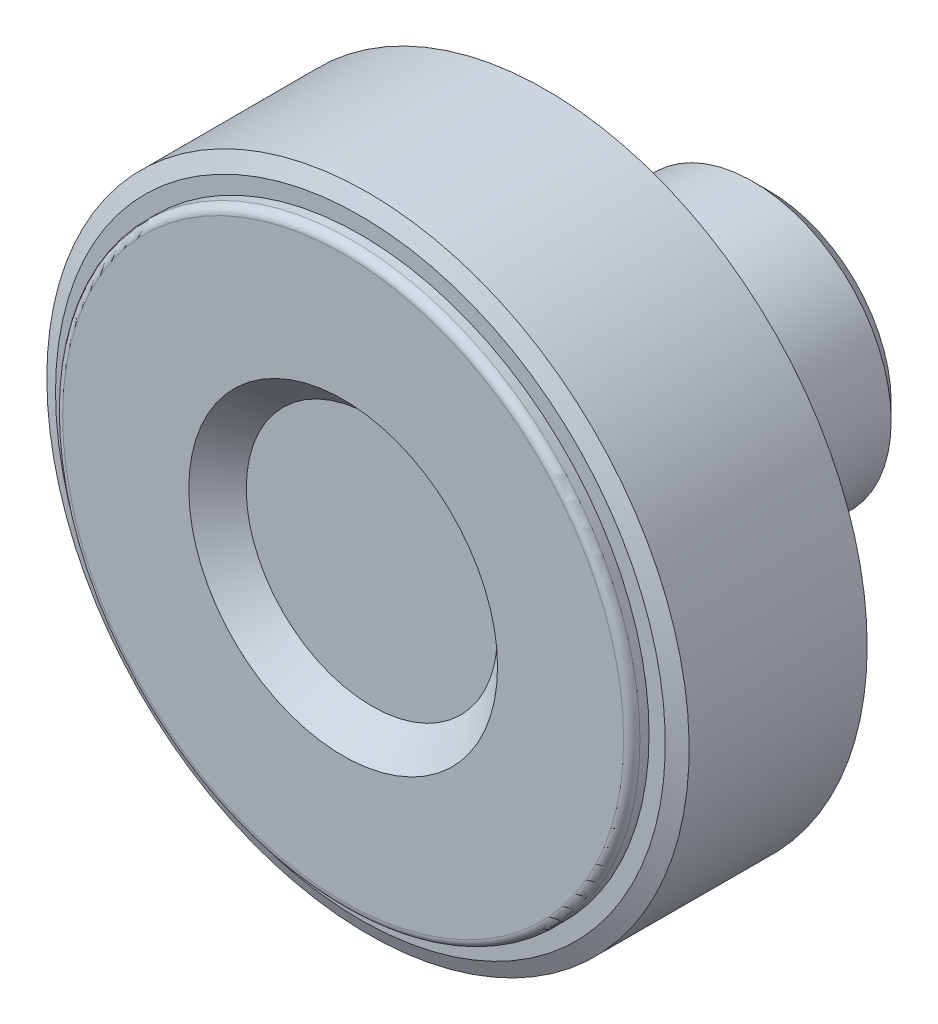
ISO-10303-21;
HEADER;
FILE_DESCRIPTION(('STEP AP214'),'2;1');
FILE_NAME('part.step','',(''),(''),'','','');
FILE_SCHEMA(('AUTOMOTIVE_DESIGN { 1 0 10303 214 1 1 1 1 }'));
ENDSEC;
DATA;
#1=APPLICATION_CONTEXT('core data for automotive mechanical design processes');
#2=APPLICATION_PROTOCOL_DEFINITION('international standard','automotive_design',2000,#1);
#3=PRODUCT_CONTEXT('',#1,'mechanical');
#4=PRODUCT('Part','Part','',(#3));
#5=PRODUCT_RELATED_PRODUCT_CATEGORY('part','',(#4));
#6=PRODUCT_DEFINITION_FORMATION('','',#4);
#7=PRODUCT_DEFINITION_CONTEXT('part definition',#1,'design');
#8=PRODUCT_DEFINITION('design','',#6,#7);
#9=PRODUCT_DEFINITION_SHAPE('','',#8);
#10=(LENGTH_UNIT() NAMED_UNIT(*) SI_UNIT(.MILLI.,.METRE.));
#11=(NAMED_UNIT(*) PLANE_ANGLE_UNIT() SI_UNIT($,.RADIAN.));
#12=(NAMED_UNIT(*) SI_UNIT($,.STERADIAN.) SOLID_ANGLE_UNIT());
#13=UNCERTAINTY_MEASURE_WITH_UNIT(LENGTH_MEASURE(1.E-05),#10,'distance_accuracy_value','');
#14=(GEOMETRIC_REPRESENTATION_CONTEXT(3) GLOBAL_UNCERTAINTY_ASSIGNED_CONTEXT((#13)) GLOBAL_UNIT_ASSIGNED_CONTEXT((#10,
#11,#12)) REPRESENTATION_CONTEXT('',''));
#15=CARTESIAN_POINT('',(0.,0.,0.));
#16=DIRECTION('',(0.,0.,1.));
#17=DIRECTION('',(1.,0.,0.));
#18=AXIS2_PLACEMENT_3D('',#15,#16,#17);
#19=CARTESIAN_POINT('',(0.,2.66666666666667,0.));
#20=DIRECTION('',(0.,0.,-1.));
#21=DIRECTION('',(-1.,0.,0.));
#22=AXIS2_PLACEMENT_3D('',#19,#20,#21);
#23=PLANE('',#22);
#24=CARTESIAN_POINT('',(0.,0.,0.));
#25=DIRECTION('',(0.,0.,-1.));
#26=DIRECTION('',(-1.,0.,0.));
#27=AXIS2_PLACEMENT_3D('',#24,#25,#26);
#28=CIRCLE('',#27,4.4999999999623);
#29=CARTESIAN_POINT('',(-4.4999999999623,0.,0.));
#30=VERTEX_POINT('',#29);
#31=EDGE_CURVE('E9',#30,#30,#28,.F.);
#32=ORIENTED_EDGE('',*,*,#31,.T.);
#33=EDGE_LOOP('',(#32));
#34=FACE_BOUND('',#33,.T.);
#35=CARTESIAN_POINT('',(0.,0.,0.));
#36=DIRECTION('',(0.,0.,1.));
#37=DIRECTION('',(1.,0.,0.));
#38=AXIS2_PLACEMENT_3D('',#35,#36,#37);
#39=CIRCLE('',#38,5.33333333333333);
#40=CARTESIAN_POINT('',(5.33333333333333,0.,0.));
#41=VERTEX_POINT('',#40);
#42=EDGE_CURVE('E211',#41,#41,#39,.T.);
#43=ORIENTED_EDGE('',*,*,#42,.F.);
#44=EDGE_LOOP('',(#43));
#45=FACE_BOUND('',#44,.T.);
#46=ADVANCED_FACE('F14',(#34,#45),#23,.T.);
#47=CARTESIAN_POINT('',(0.,0.,0.15));
#48=DIRECTION('',(0.,0.,1.));
#49=DIRECTION('',(1.,0.,0.));
#50=AXIS2_PLACEMENT_3D('',#47,#48,#49);
#51=CYLINDRICAL_SURFACE('',#50,5.33333333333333);
#52=ORIENTED_EDGE('',*,*,#42,.T.);
#53=EDGE_LOOP('',(#52));
#54=FACE_BOUND('',#53,.T.);
#55=CARTESIAN_POINT('',(0.,0.,0.3));
#56=DIRECTION('',(0.,0.,1.));
#57=DIRECTION('',(1.,0.,0.));
#58=AXIS2_PLACEMENT_3D('',#55,#56,#57);
#59=CIRCLE('',#58,5.33333333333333);
#60=CARTESIAN_POINT('',(5.33333333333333,0.,0.3));
#61=VERTEX_POINT('',#60);
#62=EDGE_CURVE('E208',#61,#61,#59,.T.);
#63=ORIENTED_EDGE('',*,*,#62,.F.);
#64=EDGE_LOOP('',(#63));
#65=FACE_BOUND('',#64,.T.);
#66=ADVANCED_FACE('F407',(#54,#65),#51,.T.);
#67=CARTESIAN_POINT('',(0.,6.41666666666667,0.3));
#68=DIRECTION('',(0.,0.,-1.));
#69=DIRECTION('',(-1.,0.,0.));
#70=AXIS2_PLACEMENT_3D('',#67,#68,#69);
#71=PLANE('',#70);
#72=CARTESIAN_POINT('',(0.,0.,0.3));
#73=DIRECTION('',(0.,0.,1.));
#74=DIRECTION('',(1.,0.,0.));
#75=AXIS2_PLACEMENT_3D('',#72,#73,#74);
#76=CIRCLE('',#75,7.5);
#77=CARTESIAN_POINT('',(7.5,0.,0.3));
#78=VERTEX_POINT('',#77);
#79=EDGE_CURVE('E177',#78,#78,#76,.T.);
#80=ORIENTED_EDGE('',*,*,#79,.F.);
#81=EDGE_LOOP('',(#80));
#82=FACE_BOUND('',#81,.T.);
#83=ORIENTED_EDGE('',*,*,#62,.T.);
#84=EDGE_LOOP('',(#83));
#85=FACE_BOUND('',#84,.T.);
#86=ADVANCED_FACE('F412',(#82,#85),#71,.T.);
#87=CARTESIAN_POINT('',(0.,0.,1.3));
#88=DIRECTION('',(0.,0.,1.));
#89=DIRECTION('',(1.,0.,0.));
#90=AXIS2_PLACEMENT_3D('',#87,#88,#89);
#91=CONICAL_SURFACE('',#90,8.5,0.785398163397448);
#92=ORIENTED_EDGE('',*,*,#79,.T.);
#93=EDGE_LOOP('',(#92));
#94=FACE_BOUND('',#93,.T.);
#95=CARTESIAN_POINT('',(0.,0.,1.3));
#96=DIRECTION('',(0.,0.,1.));
#97=DIRECTION('',(1.,0.,0.));
#98=AXIS2_PLACEMENT_3D('',#95,#96,#97);
#99=CIRCLE('',#98,8.5);
#100=CARTESIAN_POINT('',(8.5,0.,1.3));
#101=VERTEX_POINT('',#100);
#102=EDGE_CURVE('E174',#101,#101,#99,.T.);
#103=ORIENTED_EDGE('',*,*,#102,.F.);
#104=EDGE_LOOP('',(#103));
#105=FACE_BOUND('',#104,.T.);
#106=ADVANCED_FACE('F417',(#94,#105),#91,.T.);
#107=CARTESIAN_POINT('',(0.,0.,11.1916666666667));
#108=DIRECTION('',(0.,0.,1.));
#109=DIRECTION('',(1.,0.,0.));
#110=AXIS2_PLACEMENT_3D('',#107,#108,#109);
#111=CYLINDRICAL_SURFACE('',#110,8.5);
#112=ORIENTED_EDGE('',*,*,#102,.T.);
#113=EDGE_LOOP('',(#112));
#114=FACE_BOUND('',#113,.T.);
#115=CARTESIAN_POINT('',(0.,0.,21.0833333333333));
#116=DIRECTION('',(0.,0.,-1.));
#117=DIRECTION('',(-1.,0.,0.));
#118=AXIS2_PLACEMENT_3D('',#115,#116,#117);
#119=CIRCLE('',#118,8.5);
#120=CARTESIAN_POINT('',(-8.5,0.,21.0833333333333));
#121=VERTEX_POINT('',#120);
#122=EDGE_CURVE('E77',#121,#121,#119,.T.);
#123=ORIENTED_EDGE('',*,*,#122,.T.);
#124=EDGE_LOOP('',(#123));
#125=FACE_BOUND('',#124,.T.);
#126=ADVANCED_FACE('F424',(#114,#125),#111,.T.);
#127=CARTESIAN_POINT('',(0.,0.,21.0833333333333));
#128=DIRECTION('',(0.,0.,-1.));
#129=DIRECTION('',(-1.,0.,0.));
#130=AXIS2_PLACEMENT_3D('',#127,#128,#129);
#131=TOROIDAL_SURFACE('',#130,9.5,1.);
#132=CARTESIAN_POINT('',(0.,0.,22.0833333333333));
#133=DIRECTION('',(0.,0.,-1.));
#134=DIRECTION('',(1.,0.,0.));
#135=AXIS2_PLACEMENT_3D('',#132,#133,#134);
#136=CIRCLE('',#135,9.5);
#137=CARTESIAN_POINT('',(-9.5,0.,22.0833333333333));
#138=VERTEX_POINT('',#137);
#139=CARTESIAN_POINT('',(9.5,0.,22.0833333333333));
#140=VERTEX_POINT('',#139);
#141=EDGE_CURVE('E70',#138,#140,#136,.F.);
#142=ORIENTED_EDGE('',*,*,#141,.F.);
#143=CARTESIAN_POINT('',(0.,0.,22.0833333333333));
#144=DIRECTION('',(0.,0.,-1.));
#145=DIRECTION('',(-1.,0.,0.));
#146=AXIS2_PLACEMENT_3D('',#143,#144,#145);
#147=CIRCLE('',#146,9.5);
#148=CARTESIAN_POINT('',(0.,9.5,22.0833333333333));
#149=VERTEX_POINT('',#148);
#150=EDGE_CURVE('E73',#149,#138,#147,.F.);
#151=ORIENTED_EDGE('',*,*,#150,.F.);
#152=CARTESIAN_POINT('',(0.,0.,22.0833333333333));
#153=DIRECTION('',(0.,0.,-1.));
#154=DIRECTION('',(0.,1.,0.));
#155=AXIS2_PLACEMENT_3D('',#152,#153,#154);
#156=CIRCLE('',#155,9.5);
#157=EDGE_CURVE('E65',#140,#149,#156,.F.);
#158=ORIENTED_EDGE('',*,*,#157,.F.);
#159=EDGE_LOOP('',(#142,#151,#158));
#160=FACE_BOUND('',#159,.T.);
#161=ORIENTED_EDGE('',*,*,#122,.F.);
#162=EDGE_LOOP('',(#161));
#163=FACE_BOUND('',#162,.T.);
#164=ADVANCED_FACE('F68',(#160,#163),#131,.F.);
#165=CARTESIAN_POINT('',(0.,11.8461538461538,22.0833333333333));
#166=DIRECTION('',(0.,0.,-1.));
#167=DIRECTION('',(-1.,0.,0.));
#168=AXIS2_PLACEMENT_3D('',#165,#166,#167);
#169=PLANE('',#168);
#170=CARTESIAN_POINT('',(0.,0.,22.0833333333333));
#171=DIRECTION('',(0.,0.,1.));
#172=DIRECTION('',(-1.,0.,0.));
#173=AXIS2_PLACEMENT_3D('',#170,#171,#172);
#174=CIRCLE('',#173,14.1923076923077);
#175=CARTESIAN_POINT('',(14.1923076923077,0.,22.0833333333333));
#176=VERTEX_POINT('',#175);
#177=CARTESIAN_POINT('',(-14.1923076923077,0.,22.0833333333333));
#178=VERTEX_POINT('',#177);
#179=EDGE_CURVE('E83',#176,#178,#174,.F.);
#180=ORIENTED_EDGE('',*,*,#179,.T.);
#181=CARTESIAN_POINT('',(0.,0.,22.0833333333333));
#182=DIRECTION('',(0.,0.,1.));
#183=DIRECTION('',(0.,1.,0.));
#184=AXIS2_PLACEMENT_3D('',#181,#182,#183);
#185=CIRCLE('',#184,14.1923076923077);
#186=CARTESIAN_POINT('',(0.,14.1923076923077,22.0833333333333));
#187=VERTEX_POINT('',#186);
#188=EDGE_CURVE('E132',#178,#187,#185,.F.);
#189=ORIENTED_EDGE('',*,*,#188,.T.);
#190=CARTESIAN_POINT('',(0.,0.,22.0833333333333));
#191=DIRECTION('',(0.,0.,1.));
#192=DIRECTION('',(1.,0.,0.));
#193=AXIS2_PLACEMENT_3D('',#190,#191,#192);
#194=CIRCLE('',#193,14.1923076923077);
#195=EDGE_CURVE('E145',#187,#176,#194,.F.);
#196=ORIENTED_EDGE('',*,*,#195,.T.);
#197=EDGE_LOOP('',(#180,#189,#196));
#198=FACE_BOUND('',#197,.T.);
#199=ORIENTED_EDGE('',*,*,#150,.T.);
#200=ORIENTED_EDGE('',*,*,#141,.T.);
#201=ORIENTED_EDGE('',*,*,#157,.T.);
#202=EDGE_LOOP('',(#199,#200,#201));
#203=FACE_BOUND('',#202,.T.);
#204=ADVANCED_FACE('F81',(#198,#203),#169,.T.);
#205=CARTESIAN_POINT('',(0.,0.,21.0833333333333));
#206=DIRECTION('',(0.,0.,-1.));
#207=DIRECTION('',(-1.,0.,0.));
#208=AXIS2_PLACEMENT_3D('',#205,#206,#207);
#209=TOROIDAL_SURFACE('',#208,14.1923076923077,1.);
#210=ORIENTED_EDGE('',*,*,#188,.F.);
#211=ORIENTED_EDGE('',*,*,#179,.F.);
#212=ORIENTED_EDGE('',*,*,#195,.F.);
#213=EDGE_LOOP('',(#210,#211,#212));
#214=FACE_BOUND('',#213,.T.);
#215=CARTESIAN_POINT('',(0.,0.,21.0833333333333));
#216=DIRECTION('',(0.,0.,1.));
#217=DIRECTION('',(1.,0.,0.));
#218=AXIS2_PLACEMENT_3D('',#215,#216,#217);
#219=CIRCLE('',#218,15.1923076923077);
#220=CARTESIAN_POINT('',(15.1923076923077,0.,21.0833333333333));
#221=VERTEX_POINT('',#220);
#222=EDGE_CURVE('E205',#221,#221,#219,.F.);
#223=ORIENTED_EDGE('',*,*,#222,.T.);
#224=EDGE_LOOP('',(#223));
#225=FACE_BOUND('',#224,.T.);
#226=ADVANCED_FACE('F102',(#214,#225),#209,.F.);
#227=CARTESIAN_POINT('',(0.,0.,16.7916666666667));
#228=DIRECTION('',(0.,0.,1.));
#229=DIRECTION('',(1.,0.,0.));
#230=AXIS2_PLACEMENT_3D('',#227,#228,#229);
#231=CYLINDRICAL_SURFACE('',#230,15.1923076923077);
#232=ORIENTED_EDGE('',*,*,#222,.F.);
#233=EDGE_LOOP('',(#232));
#234=FACE_BOUND('',#233,.T.);
#235=CARTESIAN_POINT('',(0.,0.,12.5));
#236=DIRECTION('',(0.,0.,1.));
#237=DIRECTION('',(1.,0.,0.));
#238=AXIS2_PLACEMENT_3D('',#235,#236,#237);
#239=CIRCLE('',#238,15.1923076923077);
#240=CARTESIAN_POINT('',(15.1923076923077,0.,12.5));
#241=VERTEX_POINT('',#240);
#242=EDGE_CURVE('E201',#241,#241,#239,.T.);
#243=ORIENTED_EDGE('',*,*,#242,.F.);
#244=EDGE_LOOP('',(#243));
#245=FACE_BOUND('',#244,.T.);
#246=ADVANCED_FACE('F326',(#234,#245),#231,.F.);
#247=CARTESIAN_POINT('',(0.,16.2211538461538,12.5));
#248=DIRECTION('',(0.,0.,-1.));
#249=DIRECTION('',(-1.,0.,0.));
#250=AXIS2_PLACEMENT_3D('',#247,#248,#249);
#251=PLANE('',#250);
#252=CARTESIAN_POINT('',(0.,0.,12.5));
#253=DIRECTION('',(0.,0.,1.));
#254=DIRECTION('',(-1.,0.,0.));
#255=AXIS2_PLACEMENT_3D('',#252,#253,#254);
#256=CIRCLE('',#255,17.25);
#257=CARTESIAN_POINT('',(-17.25,0.,12.5));
#258=VERTEX_POINT('',#257);
#259=CARTESIAN_POINT('',(17.25,0.,12.5));
#260=VERTEX_POINT('',#259);
#261=EDGE_CURVE('E261',#258,#260,#256,.T.);
#262=ORIENTED_EDGE('',*,*,#261,.F.);
#263=CARTESIAN_POINT('',(0.,0.,12.5));
#264=DIRECTION('',(0.,0.,1.));
#265=DIRECTION('',(0.,1.,0.));
#266=AXIS2_PLACEMENT_3D('',#263,#264,#265);
#267=CIRCLE('',#266,17.25);
#268=CARTESIAN_POINT('',(0.,17.25,12.5));
#269=VERTEX_POINT('',#268);
#270=EDGE_CURVE('E296',#269,#258,#267,.T.);
#271=ORIENTED_EDGE('',*,*,#270,.F.);
#272=CARTESIAN_POINT('',(0.,0.,12.5));
#273=DIRECTION('',(0.,0.,1.));
#274=DIRECTION('',(1.,0.,0.));
#275=AXIS2_PLACEMENT_3D('',#272,#273,#274);
#276=CIRCLE('',#275,17.25);
#277=EDGE_CURVE('E204',#260,#269,#276,.T.);
#278=ORIENTED_EDGE('',*,*,#277,.F.);
#279=EDGE_LOOP('',(#262,#271,#278));
#280=FACE_BOUND('',#279,.T.);
#281=ORIENTED_EDGE('',*,*,#242,.T.);
#282=EDGE_LOOP('',(#281));
#283=FACE_BOUND('',#282,.T.);
#284=ADVANCED_FACE('F272',(#280,#283),#251,.T.);
#285=CARTESIAN_POINT('',(0.,0.,13.));
#286=DIRECTION('',(0.,0.,-1.));
#287=DIRECTION('',(-1.,0.,0.));
#288=AXIS2_PLACEMENT_3D('',#285,#286,#287);
#289=TOROIDAL_SURFACE('',#288,17.25,0.5);
#290=ORIENTED_EDGE('',*,*,#270,.T.);
#291=ORIENTED_EDGE('',*,*,#261,.T.);
#292=ORIENTED_EDGE('',*,*,#277,.T.);
#293=EDGE_LOOP('',(#290,#291,#292));
#294=FACE_BOUND('',#293,.T.);
#295=CARTESIAN_POINT('',(0.,0.,13.));
#296=DIRECTION('',(0.,0.,1.));
#297=DIRECTION('',(1.,0.,0.));
#298=AXIS2_PLACEMENT_3D('',#295,#296,#297);
#299=CIRCLE('',#298,17.75);
#300=CARTESIAN_POINT('',(17.75,0.,13.));
#301=VERTEX_POINT('',#300);
#302=EDGE_CURVE('E200',#301,#301,#299,.T.);
#303=ORIENTED_EDGE('',*,*,#302,.F.);
#304=EDGE_LOOP('',(#303));
#305=FACE_BOUND('',#304,.T.);
#306=ADVANCED_FACE('F266',(#294,#305),#289,.T.);
#307=CARTESIAN_POINT('',(0.,0.,13.28));
#308=DIRECTION('',(0.,0.,1.));
#309=DIRECTION('',(1.,0.,0.));
#310=AXIS2_PLACEMENT_3D('',#307,#308,#309);
#311=CYLINDRICAL_SURFACE('',#310,17.75);
#312=ORIENTED_EDGE('',*,*,#302,.T.);
#313=EDGE_LOOP('',(#312));
#314=FACE_BOUND('',#313,.T.);
#315=CARTESIAN_POINT('',(0.,0.,13.56));
#316=DIRECTION('',(0.,0.,1.));
#317=DIRECTION('',(1.,0.,0.));
#318=AXIS2_PLACEMENT_3D('',#315,#316,#317);
#319=CIRCLE('',#318,17.75);
#320=CARTESIAN_POINT('',(17.75,0.,13.56));
#321=VERTEX_POINT('',#320);
#322=EDGE_CURVE('E197',#321,#321,#319,.T.);
#323=ORIENTED_EDGE('',*,*,#322,.F.);
#324=EDGE_LOOP('',(#323));
#325=FACE_BOUND('',#324,.T.);
#326=ADVANCED_FACE('F271',(#314,#325),#311,.T.);
#327=CARTESIAN_POINT('',(0.,18.25,13.56));
#328=DIRECTION('',(0.,0.,-1.));
#329=DIRECTION('',(-1.,0.,0.));
#330=AXIS2_PLACEMENT_3D('',#327,#328,#329);
#331=PLANE('',#330);
#332=CARTESIAN_POINT('',(0.,0.,13.56));
#333=DIRECTION('',(0.,0.,1.));
#334=DIRECTION('',(1.,0.,0.));
#335=AXIS2_PLACEMENT_3D('',#332,#333,#334);
#336=CIRCLE('',#335,18.75);
#337=CARTESIAN_POINT('',(18.75,0.,13.56));
#338=VERTEX_POINT('',#337);
#339=EDGE_CURVE('E193',#338,#338,#336,.T.);
#340=ORIENTED_EDGE('',*,*,#339,.F.);
#341=EDGE_LOOP('',(#340));
#342=FACE_BOUND('',#341,.T.);
#343=ORIENTED_EDGE('',*,*,#322,.T.);
#344=EDGE_LOOP('',(#343));
#345=FACE_BOUND('',#344,.T.);
#346=ADVANCED_FACE('F340',(#342,#345),#331,.T.);
#347=CARTESIAN_POINT('',(0.,0.,14.026307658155));
#348=DIRECTION('',(0.,0.,1.));
#349=DIRECTION('',(1.,0.,0.));
#350=AXIS2_PLACEMENT_3D('',#347,#348,#349);
#351=CONICAL_SURFACE('',#350,19.75,1.13446401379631);
#352=CARTESIAN_POINT('',(-1.50102152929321E-13,-1.52766688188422E-12,14.026307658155));
#353=DIRECTION('',(0.,0.,-1.));
#354=DIRECTION('',(-1.,0.,0.));
#355=AXIS2_PLACEMENT_3D('',#352,#353,#354);
#356=CIRCLE('',#355,19.7500000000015);
#357=CARTESIAN_POINT('',(-19.7500000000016,-1.52766688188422E-12,14.026307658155));
#358=VERTEX_POINT('',#357);
#359=EDGE_CURVE('E196',#358,#358,#356,.F.);
#360=ORIENTED_EDGE('',*,*,#359,.F.);
#361=EDGE_LOOP('',(#360));
#362=FACE_BOUND('',#361,.T.);
#363=ORIENTED_EDGE('',*,*,#339,.T.);
#364=EDGE_LOOP('',(#363));
#365=FACE_BOUND('',#364,.T.);
#366=ADVANCED_FACE('F337',(#362,#365),#351,.T.);
#367=CARTESIAN_POINT('',(0.,0.,13.));
#368=DIRECTION('',(0.,0.,-1.));
#369=DIRECTION('',(-1.,0.,0.));
#370=AXIS2_PLACEMENT_3D('',#367,#368,#369);
#371=CYLINDRICAL_SURFACE('',#370,3.99999999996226);
#372=CARTESIAN_POINT('',(0.,0.,13.3));
#373=DIRECTION('',(0.,0.,-1.));
#374=DIRECTION('',(-1.,0.,0.));
#375=AXIS2_PLACEMENT_3D('',#372,#373,#374);
#376=CIRCLE('',#375,3.99999999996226);
#377=CARTESIAN_POINT('',(-3.99999999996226,0.,13.3));
#378=VERTEX_POINT('',#377);
#379=EDGE_CURVE('E214',#378,#378,#376,.T.);
#380=ORIENTED_EDGE('',*,*,#379,.F.);
#381=EDGE_LOOP('',(#380));
#382=FACE_BOUND('',#381,.T.);
#383=CARTESIAN_POINT('',(0.,0.,0.500000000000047));
#384=DIRECTION('',(0.,0.,-1.));
#385=DIRECTION('',(-1.,0.,0.));
#386=AXIS2_PLACEMENT_3D('',#383,#384,#385);
#387=CIRCLE('',#386,3.99999999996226);
#388=CARTESIAN_POINT('',(-3.99999999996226,0.,0.500000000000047));
#389=VERTEX_POINT('',#388);
#390=EDGE_CURVE('E24',#389,#389,#387,.T.);
#391=ORIENTED_EDGE('',*,*,#390,.T.);
#392=EDGE_LOOP('',(#391));
#393=FACE_BOUND('',#392,.T.);
#394=ADVANCED_FACE('F339',(#382,#393),#371,.F.);
#395=CARTESIAN_POINT('',(0.,0.,0.500000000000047));
#396=DIRECTION('',(0.,0.,-1.));
#397=DIRECTION('',(-1.,0.,0.));
#398=AXIS2_PLACEMENT_3D('',#395,#396,#397);
#399=CONICAL_SURFACE('',#398,3.99999999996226,0.785398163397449);
#400=ORIENTED_EDGE('',*,*,#31,.F.);
#401=EDGE_LOOP('',(#400));
#402=FACE_BOUND('',#401,.T.);
#403=ORIENTED_EDGE('',*,*,#390,.F.);
#404=EDGE_LOOP('',(#403));
#405=FACE_BOUND('',#404,.T.);
#406=ADVANCED_FACE('F16',(#402,#405),#399,.F.);
#407=CARTESIAN_POINT('',(0.,3.86363636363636,24.7333333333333));
#408=DIRECTION('',(0.,0.,1.));
#409=DIRECTION('',(1.,0.,0.));
#410=AXIS2_PLACEMENT_3D('',#407,#408,#409);
#411=PLANE('',#410);
#412=CARTESIAN_POINT('',(0.,0.,24.7333333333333));
#413=DIRECTION('',(0.,0.,1.));
#414=DIRECTION('',(1.,0.,0.));
#415=AXIS2_PLACEMENT_3D('',#412,#413,#414);
#416=CIRCLE('',#415,7.7272727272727);
#417=CARTESIAN_POINT('',(7.7272727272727,0.,24.7333333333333));
#418=VERTEX_POINT('',#417);
#419=EDGE_CURVE('E181',#418,#418,#416,.T.);
#420=ORIENTED_EDGE('',*,*,#419,.T.);
#421=EDGE_LOOP('',(#420));
#422=FACE_BOUND('',#421,.T.);
#423=ADVANCED_FACE('F239',(#422),#411,.T.);
#424=CARTESIAN_POINT('',(0.,0.,26.5));
#425=DIRECTION('',(0.,0.,1.));
#426=DIRECTION('',(1.,0.,0.));
#427=AXIS2_PLACEMENT_3D('',#424,#425,#426);
#428=CONICAL_SURFACE('',#427,9.49393939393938,0.785398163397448);
#429=CARTESIAN_POINT('',(0.,0.,26.5));
#430=DIRECTION('',(0.,0.,1.));
#431=DIRECTION('',(1.,0.,0.));
#432=AXIS2_PLACEMENT_3D('',#429,#430,#431);
#433=CIRCLE('',#432,9.49393939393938);
#434=CARTESIAN_POINT('',(9.49393939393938,0.,26.5));
#435=VERTEX_POINT('',#434);
#436=EDGE_CURVE('E178',#435,#435,#433,.F.);
#437=ORIENTED_EDGE('',*,*,#436,.F.);
#438=EDGE_LOOP('',(#437));
#439=FACE_BOUND('',#438,.T.);
#440=ORIENTED_EDGE('',*,*,#419,.F.);
#441=EDGE_LOOP('',(#440));
#442=FACE_BOUND('',#441,.T.);
#443=ADVANCED_FACE('F237',(#439,#442),#428,.F.);
#444=CARTESIAN_POINT('',(0.,13.3719696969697,26.5));
#445=DIRECTION('',(0.,0.,1.));
#446=DIRECTION('',(1.,0.,0.));
#447=AXIS2_PLACEMENT_3D('',#444,#445,#446);
#448=PLANE('',#447);
#449=ORIENTED_EDGE('',*,*,#436,.T.);
#450=EDGE_LOOP('',(#449));
#451=FACE_BOUND('',#450,.T.);
#452=CARTESIAN_POINT('',(0.,0.,26.5));
#453=DIRECTION('',(0.,0.,-1.));
#454=DIRECTION('',(-1.,0.,0.));
#455=AXIS2_PLACEMENT_3D('',#452,#453,#454);
#456=CIRCLE('',#455,17.25);
#457=CARTESIAN_POINT('',(0.,17.25,26.5));
#458=VERTEX_POINT('',#457);
#459=CARTESIAN_POINT('',(-17.25,0.,26.5));
#460=VERTEX_POINT('',#459);
#461=EDGE_CURVE('E216',#458,#460,#456,.F.);
#462=ORIENTED_EDGE('',*,*,#461,.T.);
#463=CARTESIAN_POINT('',(0.,0.,26.5));
#464=DIRECTION('',(0.,0.,-1.));
#465=DIRECTION('',(1.,0.,0.));
#466=AXIS2_PLACEMENT_3D('',#463,#464,#465);
#467=CIRCLE('',#466,17.25);
#468=CARTESIAN_POINT('',(17.25,0.,26.5));
#469=VERTEX_POINT('',#468);
#470=EDGE_CURVE('E33',#460,#469,#467,.F.);
#471=ORIENTED_EDGE('',*,*,#470,.T.);
#472=CARTESIAN_POINT('',(0.,0.,26.5));
#473=DIRECTION('',(0.,0.,-1.));
#474=DIRECTION('',(0.,1.,0.));
#475=AXIS2_PLACEMENT_3D('',#472,#473,#474);
#476=CIRCLE('',#475,17.25);
#477=EDGE_CURVE('E184',#469,#458,#476,.F.);
#478=ORIENTED_EDGE('',*,*,#477,.T.);
#479=EDGE_LOOP('',(#462,#471,#478));
#480=FACE_BOUND('',#479,.T.);
#481=ADVANCED_FACE('F235',(#451,#480),#448,.T.);
#482=CARTESIAN_POINT('',(0.,0.,26.));
#483=DIRECTION('',(0.,0.,-1.));
#484=DIRECTION('',(-1.,0.,0.));
#485=AXIS2_PLACEMENT_3D('',#482,#483,#484);
#486=TOROIDAL_SURFACE('',#485,17.25,0.5);
#487=CARTESIAN_POINT('',(0.,0.,26.));
#488=DIRECTION('',(0.,0.,-1.));
#489=DIRECTION('',(-1.,0.,0.));
#490=AXIS2_PLACEMENT_3D('',#487,#488,#489);
#491=CIRCLE('',#490,17.75);
#492=CARTESIAN_POINT('',(-17.75,0.,26.));
#493=VERTEX_POINT('',#492);
#494=EDGE_CURVE('E185',#493,#493,#491,.F.);
#495=ORIENTED_EDGE('',*,*,#494,.T.);
#496=EDGE_LOOP('',(#495));
#497=FACE_BOUND('',#496,.T.);
#498=ORIENTED_EDGE('',*,*,#470,.F.);
#499=ORIENTED_EDGE('',*,*,#461,.F.);
#500=ORIENTED_EDGE('',*,*,#477,.F.);
#501=EDGE_LOOP('',(#498,#499,#500));
#502=FACE_BOUND('',#501,.T.);
#503=ADVANCED_FACE('F223',(#497,#502),#486,.T.);
#504=CARTESIAN_POINT('',(0.,0.,25.72));
#505=DIRECTION('',(0.,0.,1.));
#506=DIRECTION('',(1.,0.,0.));
#507=AXIS2_PLACEMENT_3D('',#504,#505,#506);
#508=CYLINDRICAL_SURFACE('',#507,17.75);
#509=ORIENTED_EDGE('',*,*,#494,.F.);
#510=EDGE_LOOP('',(#509));
#511=FACE_BOUND('',#510,.T.);
#512=CARTESIAN_POINT('',(0.,0.,25.44));
#513=DIRECTION('',(0.,0.,1.));
#514=DIRECTION('',(1.,0.,0.));
#515=AXIS2_PLACEMENT_3D('',#512,#513,#514);
#516=CIRCLE('',#515,17.75);
#517=CARTESIAN_POINT('',(17.75,0.,25.44));
#518=VERTEX_POINT('',#517);
#519=EDGE_CURVE('E186',#518,#518,#516,.T.);
#520=ORIENTED_EDGE('',*,*,#519,.T.);
#521=EDGE_LOOP('',(#520));
#522=FACE_BOUND('',#521,.T.);
#523=ADVANCED_FACE('F234',(#511,#522),#508,.T.);
#524=CARTESIAN_POINT('',(0.,0.,24.973692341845));
#525=DIRECTION('',(0.,0.,-1.));
#526=DIRECTION('',(-1.,0.,0.));
#527=AXIS2_PLACEMENT_3D('',#524,#525,#526);
#528=CONICAL_SURFACE('',#527,19.75,1.13446401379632);
#529=CARTESIAN_POINT('',(0.,0.,25.44));
#530=DIRECTION('',(0.,0.,-1.));
#531=DIRECTION('',(-1.,0.,0.));
#532=AXIS2_PLACEMENT_3D('',#529,#530,#531);
#533=CIRCLE('',#532,18.75);
#534=CARTESIAN_POINT('',(-18.75,0.,25.44));
#535=VERTEX_POINT('',#534);
#536=EDGE_CURVE('E189',#535,#535,#533,.F.);
#537=ORIENTED_EDGE('',*,*,#536,.F.);
#538=EDGE_LOOP('',(#537));
#539=FACE_BOUND('',#538,.T.);
#540=CARTESIAN_POINT('',(0.,0.,24.973692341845));
#541=DIRECTION('',(0.,0.,-1.));
#542=DIRECTION('',(0.,1.,0.));
#543=AXIS2_PLACEMENT_3D('',#540,#541,#542);
#544=CIRCLE('',#543,19.75);
#545=CARTESIAN_POINT('',(0.,19.75,24.973692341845));
#546=VERTEX_POINT('',#545);
#547=EDGE_CURVE('E192',#546,#546,#544,.F.);
#548=ORIENTED_EDGE('',*,*,#547,.T.);
#549=EDGE_LOOP('',(#548));
#550=FACE_BOUND('',#549,.T.);
#551=ADVANCED_FACE('F360',(#539,#550),#528,.T.);
#552=CARTESIAN_POINT('',(0.,18.25,25.44));
#553=DIRECTION('',(0.,0.,1.));
#554=DIRECTION('',(1.,0.,0.));
#555=AXIS2_PLACEMENT_3D('',#552,#553,#554);
#556=PLANE('',#555);
#557=ORIENTED_EDGE('',*,*,#519,.F.);
#558=EDGE_LOOP('',(#557));
#559=FACE_BOUND('',#558,.T.);
#560=ORIENTED_EDGE('',*,*,#536,.T.);
#561=EDGE_LOOP('',(#560));
#562=FACE_BOUND('',#561,.T.);
#563=ADVANCED_FACE('F358',(#559,#562),#556,.T.);
#564=CARTESIAN_POINT('',(-1.50102152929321E-13,-1.52766688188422E-12,0.));
#565=DIRECTION('',(0.,0.,-1.));
#566=DIRECTION('',(-1.,0.,0.));
#567=AXIS2_PLACEMENT_3D('',#564,#565,#566);
#568=CYLINDRICAL_SURFACE('',#567,19.7500000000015);
#569=ORIENTED_EDGE('',*,*,#359,.T.);
#570=EDGE_LOOP('',(#569));
#571=FACE_BOUND('',#570,.T.);
#572=ORIENTED_EDGE('',*,*,#547,.F.);
#573=EDGE_LOOP('',(#572));
#574=FACE_BOUND('',#573,.T.);
#575=ADVANCED_FACE('F354',(#571,#574),#568,.T.);
#576=CARTESIAN_POINT('',(0.,0.,13.3));
#577=DIRECTION('',(0.,0.,-1.));
#578=DIRECTION('',(-1.,0.,0.));
#579=AXIS2_PLACEMENT_3D('',#576,#577,#578);
#580=PLANE('',#579);
#581=ORIENTED_EDGE('',*,*,#379,.T.);
#582=EDGE_LOOP('',(#581));
#583=FACE_BOUND('',#582,.T.);
#584=ADVANCED_FACE('F357',(#583),#580,.T.);
#585=CLOSED_SHELL('',(#46,#66,#86,#106,#126,#164,#204,#226,#246,#284,#306,#326,#346,#366,#394,
#406,#423,#443,#481,#503,#523,#551,#563,#575,#584));
#586=MANIFOLD_SOLID_BREP('B1',#585);
#587=ADVANCED_BREP_SHAPE_REPRESENTATION('',(#18,#586),#14);
#588=SHAPE_DEFINITION_REPRESENTATION(#9,#587);
ENDSEC;
END-ISO-10303-21;
